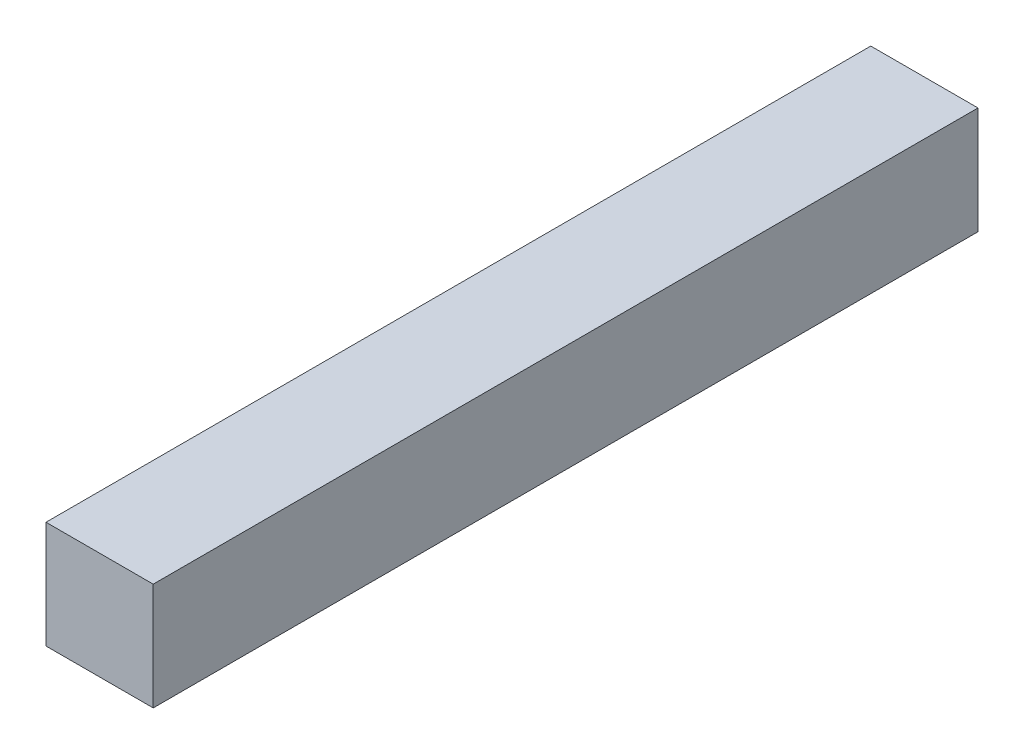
ISO-10303-21;
HEADER;
FILE_DESCRIPTION(('STEP AP214'),'2;1');
FILE_NAME('part.step','',(''),(''),'','','');
FILE_SCHEMA(('AUTOMOTIVE_DESIGN { 1 0 10303 214 1 1 1 1 }'));
ENDSEC;
DATA;
#1=APPLICATION_CONTEXT('core data for automotive mechanical design processes');
#2=APPLICATION_PROTOCOL_DEFINITION('international standard','automotive_design',2000,#1);
#3=PRODUCT_CONTEXT('',#1,'mechanical');
#4=PRODUCT('Part','Part','',(#3));
#5=PRODUCT_RELATED_PRODUCT_CATEGORY('part','',(#4));
#6=PRODUCT_DEFINITION_FORMATION('','',#4);
#7=PRODUCT_DEFINITION_CONTEXT('part definition',#1,'design');
#8=PRODUCT_DEFINITION('design','',#6,#7);
#9=PRODUCT_DEFINITION_SHAPE('','',#8);
#10=(LENGTH_UNIT() NAMED_UNIT(*) SI_UNIT(.MILLI.,.METRE.));
#11=(NAMED_UNIT(*) PLANE_ANGLE_UNIT() SI_UNIT($,.RADIAN.));
#12=(NAMED_UNIT(*) SI_UNIT($,.STERADIAN.) SOLID_ANGLE_UNIT());
#13=UNCERTAINTY_MEASURE_WITH_UNIT(LENGTH_MEASURE(1.E-05),#10,'distance_accuracy_value','');
#14=(GEOMETRIC_REPRESENTATION_CONTEXT(3) GLOBAL_UNCERTAINTY_ASSIGNED_CONTEXT((#13)) GLOBAL_UNIT_ASSIGNED_CONTEXT((#10,
#11,#12)) REPRESENTATION_CONTEXT('',''));
#15=CARTESIAN_POINT('',(0.,0.,0.));
#16=DIRECTION('',(0.,0.,1.));
#17=DIRECTION('',(1.,0.,0.));
#18=AXIS2_PLACEMENT_3D('',#15,#16,#17);
#19=CARTESIAN_POINT('',(-6.5,6.5,50.));
#20=DIRECTION('',(1.,0.,0.));
#21=DIRECTION('',(0.,0.,-1.));
#22=AXIS2_PLACEMENT_3D('',#19,#20,#21);
#23=PLANE('',#22);
#24=DIRECTION('',(0.,-1.,0.));
#25=VECTOR('',#24,1.);
#26=CARTESIAN_POINT('',(-6.5,6.5,-50.));
#27=LINE('',#26,#25);
#28=CARTESIAN_POINT('',(-6.5,6.5,-50.));
#29=VERTEX_POINT('',#28);
#30=CARTESIAN_POINT('',(-6.5,-6.5,-50.));
#31=VERTEX_POINT('',#30);
#32=EDGE_CURVE('E74',#29,#31,#27,.T.);
#33=ORIENTED_EDGE('',*,*,#32,.T.);
#34=DIRECTION('',(0.,0.,-1.));
#35=VECTOR('',#34,1.);
#36=CARTESIAN_POINT('',(-6.5,-6.5,50.));
#37=LINE('',#36,#35);
#38=CARTESIAN_POINT('',(-6.5,-6.5,50.));
#39=VERTEX_POINT('',#38);
#40=EDGE_CURVE('E11',#39,#31,#37,.T.);
#41=ORIENTED_EDGE('',*,*,#40,.F.);
#42=DIRECTION('',(0.,-1.,0.));
#43=VECTOR('',#42,1.);
#44=CARTESIAN_POINT('',(-6.5,6.5,50.));
#45=LINE('',#44,#43);
#46=CARTESIAN_POINT('',(-6.5,6.5,50.));
#47=VERTEX_POINT('',#46);
#48=EDGE_CURVE('E92',#47,#39,#45,.T.);
#49=ORIENTED_EDGE('',*,*,#48,.F.);
#50=DIRECTION('',(0.,0.,-1.));
#51=VECTOR('',#50,1.);
#52=CARTESIAN_POINT('',(-6.5,6.5,50.));
#53=LINE('',#52,#51);
#54=EDGE_CURVE('E86',#47,#29,#53,.T.);
#55=ORIENTED_EDGE('',*,*,#54,.T.);
#56=EDGE_LOOP('',(#33,#41,#49,#55));
#57=FACE_BOUND('',#56,.T.);
#58=ADVANCED_FACE('F30',(#57),#23,.F.);
#59=CARTESIAN_POINT('',(-6.5,-6.5,50.));
#60=DIRECTION('',(0.,1.,0.));
#61=DIRECTION('',(0.,0.,1.));
#62=AXIS2_PLACEMENT_3D('',#59,#60,#61);
#63=PLANE('',#62);
#64=DIRECTION('',(1.,0.,0.));
#65=VECTOR('',#64,1.);
#66=CARTESIAN_POINT('',(-6.5,-6.5,-50.));
#67=LINE('',#66,#65);
#68=CARTESIAN_POINT('',(6.5,-6.5,-50.));
#69=VERTEX_POINT('',#68);
#70=EDGE_CURVE('E70',#31,#69,#67,.T.);
#71=ORIENTED_EDGE('',*,*,#70,.T.);
#72=DIRECTION('',(0.,0.,-1.));
#73=VECTOR('',#72,1.);
#74=CARTESIAN_POINT('',(6.5,-6.5,50.));
#75=LINE('',#74,#73);
#76=CARTESIAN_POINT('',(6.5,-6.5,50.));
#77=VERTEX_POINT('',#76);
#78=EDGE_CURVE('E37',#77,#69,#75,.T.);
#79=ORIENTED_EDGE('',*,*,#78,.F.);
#80=DIRECTION('',(1.,0.,0.));
#81=VECTOR('',#80,1.);
#82=CARTESIAN_POINT('',(-6.5,-6.5,50.));
#83=LINE('',#82,#81);
#84=EDGE_CURVE('E82',#39,#77,#83,.T.);
#85=ORIENTED_EDGE('',*,*,#84,.F.);
#86=ORIENTED_EDGE('',*,*,#40,.T.);
#87=EDGE_LOOP('',(#71,#79,#85,#86));
#88=FACE_BOUND('',#87,.T.);
#89=ADVANCED_FACE('F81',(#88),#63,.F.);
#90=CARTESIAN_POINT('',(6.5,6.5,50.));
#91=DIRECTION('',(-1.,0.,0.));
#92=DIRECTION('',(0.,0.,1.));
#93=AXIS2_PLACEMENT_3D('',#90,#91,#92);
#94=PLANE('',#93);
#95=DIRECTION('',(0.,1.,0.));
#96=VECTOR('',#95,1.);
#97=CARTESIAN_POINT('',(6.5,6.5,-50.));
#98=LINE('',#97,#96);
#99=CARTESIAN_POINT('',(6.5,6.5,-50.));
#100=VERTEX_POINT('',#99);
#101=EDGE_CURVE('E75',#69,#100,#98,.T.);
#102=ORIENTED_EDGE('',*,*,#101,.T.);
#103=DIRECTION('',(0.,0.,-1.));
#104=VECTOR('',#103,1.);
#105=CARTESIAN_POINT('',(6.5,6.5,50.));
#106=LINE('',#105,#104);
#107=CARTESIAN_POINT('',(6.5,6.5,50.));
#108=VERTEX_POINT('',#107);
#109=EDGE_CURVE('E98',#108,#100,#106,.T.);
#110=ORIENTED_EDGE('',*,*,#109,.F.);
#111=DIRECTION('',(0.,1.,0.));
#112=VECTOR('',#111,1.);
#113=CARTESIAN_POINT('',(6.5,6.5,50.));
#114=LINE('',#113,#112);
#115=EDGE_CURVE('E49',#77,#108,#114,.T.);
#116=ORIENTED_EDGE('',*,*,#115,.F.);
#117=ORIENTED_EDGE('',*,*,#78,.T.);
#118=EDGE_LOOP('',(#102,#110,#116,#117));
#119=FACE_BOUND('',#118,.T.);
#120=ADVANCED_FACE('F101',(#119),#94,.F.);
#121=CARTESIAN_POINT('',(-6.5,6.5,50.));
#122=DIRECTION('',(0.,-1.,0.));
#123=DIRECTION('',(0.,0.,-1.));
#124=AXIS2_PLACEMENT_3D('',#121,#122,#123);
#125=PLANE('',#124);
#126=DIRECTION('',(-1.,0.,0.));
#127=VECTOR('',#126,1.);
#128=CARTESIAN_POINT('',(-6.5,6.5,-50.));
#129=LINE('',#128,#127);
#130=EDGE_CURVE('E90',#100,#29,#129,.T.);
#131=ORIENTED_EDGE('',*,*,#130,.T.);
#132=ORIENTED_EDGE('',*,*,#54,.F.);
#133=DIRECTION('',(-1.,0.,0.));
#134=VECTOR('',#133,1.);
#135=CARTESIAN_POINT('',(-6.5,6.5,50.));
#136=LINE('',#135,#134);
#137=EDGE_CURVE('E44',#108,#47,#136,.T.);
#138=ORIENTED_EDGE('',*,*,#137,.F.);
#139=ORIENTED_EDGE('',*,*,#109,.T.);
#140=EDGE_LOOP('',(#131,#132,#138,#139));
#141=FACE_BOUND('',#140,.T.);
#142=ADVANCED_FACE('F103',(#141),#125,.F.);
#143=CARTESIAN_POINT('',(-6.5,-6.5,50.));
#144=DIRECTION('',(0.,0.,1.));
#145=DIRECTION('',(1.,0.,0.));
#146=AXIS2_PLACEMENT_3D('',#143,#144,#145);
#147=PLANE('',#146);
#148=ORIENTED_EDGE('',*,*,#48,.T.);
#149=ORIENTED_EDGE('',*,*,#84,.T.);
#150=ORIENTED_EDGE('',*,*,#115,.T.);
#151=ORIENTED_EDGE('',*,*,#137,.T.);
#152=EDGE_LOOP('',(#148,#149,#150,#151));
#153=FACE_BOUND('',#152,.T.);
#154=ADVANCED_FACE('F104',(#153),#147,.T.);
#155=CARTESIAN_POINT('',(-6.5,-6.5,-50.));
#156=DIRECTION('',(0.,0.,1.));
#157=DIRECTION('',(1.,0.,0.));
#158=AXIS2_PLACEMENT_3D('',#155,#156,#157);
#159=PLANE('',#158);
#160=ORIENTED_EDGE('',*,*,#32,.F.);
#161=ORIENTED_EDGE('',*,*,#130,.F.);
#162=ORIENTED_EDGE('',*,*,#101,.F.);
#163=ORIENTED_EDGE('',*,*,#70,.F.);
#164=EDGE_LOOP('',(#160,#161,#162,#163));
#165=FACE_BOUND('',#164,.T.);
#166=ADVANCED_FACE('F71',(#165),#159,.F.);
#167=CLOSED_SHELL('',(#58,#89,#120,#142,#154,#166));
#168=MANIFOLD_SOLID_BREP('B2',#167);
#169=ADVANCED_BREP_SHAPE_REPRESENTATION('',(#18,#168),#14);
#170=SHAPE_DEFINITION_REPRESENTATION(#9,#169);
ENDSEC;
END-ISO-10303-21;
